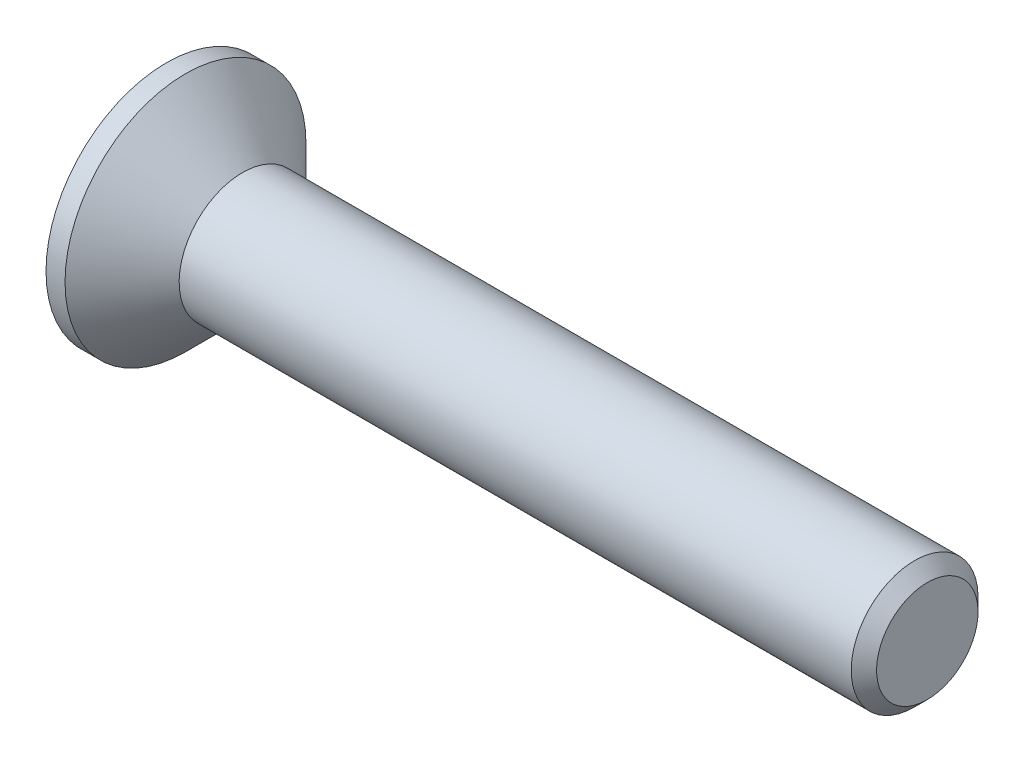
ISO-10303-21;
HEADER;
FILE_DESCRIPTION(('STEP AP214'),'2;1');
FILE_NAME('part.step','',(''),(''),'','','');
FILE_SCHEMA(('AUTOMOTIVE_DESIGN { 1 0 10303 214 1 1 1 1 }'));
ENDSEC;
DATA;
#1=APPLICATION_CONTEXT('core data for automotive mechanical design processes');
#2=APPLICATION_PROTOCOL_DEFINITION('international standard','automotive_design',2000,#1);
#3=PRODUCT_CONTEXT('',#1,'mechanical');
#4=PRODUCT('Part','Part','',(#3));
#5=PRODUCT_RELATED_PRODUCT_CATEGORY('part','',(#4));
#6=PRODUCT_DEFINITION_FORMATION('','',#4);
#7=PRODUCT_DEFINITION_CONTEXT('part definition',#1,'design');
#8=PRODUCT_DEFINITION('design','',#6,#7);
#9=PRODUCT_DEFINITION_SHAPE('','',#8);
#10=(LENGTH_UNIT() NAMED_UNIT(*) SI_UNIT(.MILLI.,.METRE.));
#11=(NAMED_UNIT(*) PLANE_ANGLE_UNIT() SI_UNIT($,.RADIAN.));
#12=(NAMED_UNIT(*) SI_UNIT($,.STERADIAN.) SOLID_ANGLE_UNIT());
#13=UNCERTAINTY_MEASURE_WITH_UNIT(LENGTH_MEASURE(1.E-05),#10,'distance_accuracy_value','');
#14=(GEOMETRIC_REPRESENTATION_CONTEXT(3) GLOBAL_UNCERTAINTY_ASSIGNED_CONTEXT((#13)) GLOBAL_UNIT_ASSIGNED_CONTEXT((#10,
#11,#12)) REPRESENTATION_CONTEXT('',''));
#15=CARTESIAN_POINT('',(0.,0.,0.));
#16=DIRECTION('',(0.,0.,1.));
#17=DIRECTION('',(1.,0.,0.));
#18=AXIS2_PLACEMENT_3D('',#15,#16,#17);
#19=CARTESIAN_POINT('',(0.,0.,0.));
#20=DIRECTION('',(-1.,0.,0.));
#21=DIRECTION('',(0.,-1.,0.));
#22=AXIS2_PLACEMENT_3D('',#19,#20,#21);
#23=CONICAL_SURFACE('',#22,1.,0.78539816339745);
#24=CARTESIAN_POINT('',(-0.899999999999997,0.,0.));
#25=DIRECTION('',(-1.,0.,0.));
#26=DIRECTION('',(0.,-1.,0.));
#27=AXIS2_PLACEMENT_3D('',#24,#25,#26);
#28=CIRCLE('',#27,1.9);
#29=CARTESIAN_POINT('',(-0.899999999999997,-1.9,0.));
#30=VERTEX_POINT('',#29);
#31=EDGE_CURVE('E189',#30,#30,#28,.T.);
#32=ORIENTED_EDGE('',*,*,#31,.F.);
#33=EDGE_LOOP('',(#32));
#34=FACE_BOUND('',#33,.T.);
#35=CARTESIAN_POINT('',(0.,0.,0.));
#36=DIRECTION('',(-1.,0.,0.));
#37=DIRECTION('',(0.,-1.,0.));
#38=AXIS2_PLACEMENT_3D('',#35,#36,#37);
#39=CIRCLE('',#38,1.);
#40=CARTESIAN_POINT('',(0.,-1.,0.));
#41=VERTEX_POINT('',#40);
#42=EDGE_CURVE('E212',#41,#41,#39,.T.);
#43=ORIENTED_EDGE('',*,*,#42,.T.);
#44=EDGE_LOOP('',(#43));
#45=FACE_BOUND('',#44,.T.);
#46=ADVANCED_FACE('F33',(#34,#45),#23,.T.);
#47=CARTESIAN_POINT('',(-1.2,0.,0.));
#48=DIRECTION('',(-1.,0.,0.));
#49=DIRECTION('',(0.,-1.,0.));
#50=AXIS2_PLACEMENT_3D('',#47,#48,#49);
#51=CYLINDRICAL_SURFACE('',#50,1.);
#52=CARTESIAN_POINT('',(10.6,0.,0.));
#53=DIRECTION('',(-1.,0.,0.));
#54=DIRECTION('',(0.,-1.,0.));
#55=AXIS2_PLACEMENT_3D('',#52,#53,#54);
#56=CIRCLE('',#55,1.);
#57=CARTESIAN_POINT('',(10.6,-1.,0.));
#58=VERTEX_POINT('',#57);
#59=EDGE_CURVE('E41',#58,#58,#56,.T.);
#60=ORIENTED_EDGE('',*,*,#59,.T.);
#61=EDGE_LOOP('',(#60));
#62=FACE_BOUND('',#61,.T.);
#63=ORIENTED_EDGE('',*,*,#42,.F.);
#64=EDGE_LOOP('',(#63));
#65=FACE_BOUND('',#64,.T.);
#66=ADVANCED_FACE('F217',(#62,#65),#51,.T.);
#67=CARTESIAN_POINT('',(10.8,0.,0.));
#68=DIRECTION('',(-1.,0.,0.));
#69=DIRECTION('',(0.,-1.,0.));
#70=AXIS2_PLACEMENT_3D('',#67,#68,#69);
#71=PLANE('',#70);
#72=CARTESIAN_POINT('',(10.8,0.,0.));
#73=DIRECTION('',(-1.,0.,0.));
#74=DIRECTION('',(0.,-1.,0.));
#75=AXIS2_PLACEMENT_3D('',#72,#73,#74);
#76=CIRCLE('',#75,0.800000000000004);
#77=CARTESIAN_POINT('',(10.8,-0.800000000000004,0.));
#78=VERTEX_POINT('',#77);
#79=EDGE_CURVE('E11',#78,#78,#76,.F.);
#80=ORIENTED_EDGE('',*,*,#79,.T.);
#81=EDGE_LOOP('',(#80));
#82=FACE_BOUND('',#81,.T.);
#83=ADVANCED_FACE('F239',(#82),#71,.F.);
#84=CARTESIAN_POINT('',(-1.2,1.9,0.));
#85=DIRECTION('',(1.,0.,0.));
#86=DIRECTION('',(0.,1.,0.));
#87=AXIS2_PLACEMENT_3D('',#84,#85,#86);
#88=PLANE('',#87);
#89=DIRECTION('',(0.,0.,-1.));
#90=VECTOR('',#89,1.);
#91=CARTESIAN_POINT('',(-1.2,0.3,-1.175));
#92=LINE('',#91,#90);
#93=CARTESIAN_POINT('',(-1.2,0.3,-0.3));
#94=VERTEX_POINT('',#93);
#95=CARTESIAN_POINT('',(-1.2,0.3,-1.175));
#96=VERTEX_POINT('',#95);
#97=EDGE_CURVE('E158',#94,#96,#92,.T.);
#98=ORIENTED_EDGE('',*,*,#97,.F.);
#99=DIRECTION('',(0.,-1.,0.));
#100=VECTOR('',#99,1.);
#101=CARTESIAN_POINT('',(-1.2,0.3,-0.3));
#102=LINE('',#101,#100);
#103=CARTESIAN_POINT('',(-1.2,1.175,-0.3));
#104=VERTEX_POINT('',#103);
#105=EDGE_CURVE('E48',#104,#94,#102,.T.);
#106=ORIENTED_EDGE('',*,*,#105,.F.);
#107=DIRECTION('',(0.,0.,-1.));
#108=VECTOR('',#107,1.);
#109=CARTESIAN_POINT('',(-1.2,1.175,-0.3));
#110=LINE('',#109,#108);
#111=CARTESIAN_POINT('',(-1.2,1.175,0.3));
#112=VERTEX_POINT('',#111);
#113=EDGE_CURVE('E185',#112,#104,#110,.T.);
#114=ORIENTED_EDGE('',*,*,#113,.F.);
#115=DIRECTION('',(0.,1.,0.));
#116=VECTOR('',#115,1.);
#117=CARTESIAN_POINT('',(-1.2,1.175,0.3));
#118=LINE('',#117,#116);
#119=CARTESIAN_POINT('',(-1.2,0.3,0.3));
#120=VERTEX_POINT('',#119);
#121=EDGE_CURVE('E183',#120,#112,#118,.T.);
#122=ORIENTED_EDGE('',*,*,#121,.F.);
#123=DIRECTION('',(0.,0.,-1.));
#124=VECTOR('',#123,1.);
#125=CARTESIAN_POINT('',(-1.2,0.3,0.3));
#126=LINE('',#125,#124);
#127=CARTESIAN_POINT('',(-1.2,0.3,1.175));
#128=VERTEX_POINT('',#127);
#129=EDGE_CURVE('E132',#128,#120,#126,.T.);
#130=ORIENTED_EDGE('',*,*,#129,.F.);
#131=DIRECTION('',(0.,1.,0.));
#132=VECTOR('',#131,1.);
#133=CARTESIAN_POINT('',(-1.2,0.3,1.175));
#134=LINE('',#133,#132);
#135=CARTESIAN_POINT('',(-1.2,-0.3,1.175));
#136=VERTEX_POINT('',#135);
#137=EDGE_CURVE('E179',#136,#128,#134,.T.);
#138=ORIENTED_EDGE('',*,*,#137,.F.);
#139=DIRECTION('',(0.,0.,1.));
#140=VECTOR('',#139,1.);
#141=CARTESIAN_POINT('',(-1.2,-0.3,1.175));
#142=LINE('',#141,#140);
#143=CARTESIAN_POINT('',(-1.2,-0.3,0.3));
#144=VERTEX_POINT('',#143);
#145=EDGE_CURVE('E176',#144,#136,#142,.T.);
#146=ORIENTED_EDGE('',*,*,#145,.F.);
#147=DIRECTION('',(0.,1.,0.));
#148=VECTOR('',#147,1.);
#149=CARTESIAN_POINT('',(-1.2,-0.3,0.3));
#150=LINE('',#149,#148);
#151=CARTESIAN_POINT('',(-1.2,-1.175,0.3));
#152=VERTEX_POINT('',#151);
#153=EDGE_CURVE('E173',#152,#144,#150,.T.);
#154=ORIENTED_EDGE('',*,*,#153,.F.);
#155=DIRECTION('',(0.,0.,1.));
#156=VECTOR('',#155,1.);
#157=CARTESIAN_POINT('',(-1.2,-1.175,0.3));
#158=LINE('',#157,#156);
#159=CARTESIAN_POINT('',(-1.2,-1.175,-0.3));
#160=VERTEX_POINT('',#159);
#161=EDGE_CURVE('E170',#160,#152,#158,.T.);
#162=ORIENTED_EDGE('',*,*,#161,.F.);
#163=DIRECTION('',(0.,-1.,0.));
#164=VECTOR('',#163,1.);
#165=CARTESIAN_POINT('',(-1.2,-1.175,-0.3));
#166=LINE('',#165,#164);
#167=CARTESIAN_POINT('',(-1.2,-0.3,-0.3));
#168=VERTEX_POINT('',#167);
#169=EDGE_CURVE('E167',#168,#160,#166,.T.);
#170=ORIENTED_EDGE('',*,*,#169,.F.);
#171=DIRECTION('',(0.,0.,1.));
#172=VECTOR('',#171,1.);
#173=CARTESIAN_POINT('',(-1.2,-0.3,-0.3));
#174=LINE('',#173,#172);
#175=CARTESIAN_POINT('',(-1.2,-0.3,-1.175));
#176=VERTEX_POINT('',#175);
#177=EDGE_CURVE('E164',#176,#168,#174,.T.);
#178=ORIENTED_EDGE('',*,*,#177,.F.);
#179=DIRECTION('',(0.,-1.,0.));
#180=VECTOR('',#179,1.);
#181=CARTESIAN_POINT('',(-1.2,-0.3,-1.175));
#182=LINE('',#181,#180);
#183=EDGE_CURVE('E161',#96,#176,#182,.T.);
#184=ORIENTED_EDGE('',*,*,#183,.F.);
#185=EDGE_LOOP('',(#98,#106,#114,#122,#130,#138,#146,#154,#162,#170,#178,#184));
#186=FACE_BOUND('',#185,.T.);
#187=CARTESIAN_POINT('',(-1.2,0.,0.));
#188=DIRECTION('',(-1.,0.,0.));
#189=DIRECTION('',(0.,-1.,0.));
#190=AXIS2_PLACEMENT_3D('',#187,#188,#189);
#191=CIRCLE('',#190,1.9);
#192=CARTESIAN_POINT('',(-1.2,-1.9,0.));
#193=VERTEX_POINT('',#192);
#194=EDGE_CURVE('E209',#193,#193,#191,.T.);
#195=ORIENTED_EDGE('',*,*,#194,.T.);
#196=EDGE_LOOP('',(#195));
#197=FACE_BOUND('',#196,.T.);
#198=ADVANCED_FACE('F230',(#186,#197),#88,.F.);
#199=CARTESIAN_POINT('',(-1.2,0.,0.));
#200=DIRECTION('',(-1.,0.,0.));
#201=DIRECTION('',(0.,-1.,0.));
#202=AXIS2_PLACEMENT_3D('',#199,#200,#201);
#203=CYLINDRICAL_SURFACE('',#202,1.9);
#204=ORIENTED_EDGE('',*,*,#194,.F.);
#205=EDGE_LOOP('',(#204));
#206=FACE_BOUND('',#205,.T.);
#207=ORIENTED_EDGE('',*,*,#31,.T.);
#208=EDGE_LOOP('',(#207));
#209=FACE_BOUND('',#208,.T.);
#210=ADVANCED_FACE('F222',(#206,#209),#203,.T.);
#211=CARTESIAN_POINT('',(10.6,0.,0.));
#212=DIRECTION('',(-1.,0.,0.));
#213=DIRECTION('',(0.,-1.,0.));
#214=AXIS2_PLACEMENT_3D('',#211,#212,#213);
#215=CONICAL_SURFACE('',#214,1.,0.785398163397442);
#216=ORIENTED_EDGE('',*,*,#79,.F.);
#217=EDGE_LOOP('',(#216));
#218=FACE_BOUND('',#217,.T.);
#219=ORIENTED_EDGE('',*,*,#59,.F.);
#220=EDGE_LOOP('',(#219));
#221=FACE_BOUND('',#220,.T.);
#222=ADVANCED_FACE('F35',(#218,#221),#215,.T.);
#223=CARTESIAN_POINT('',(-0.249999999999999,0.3,-0.3));
#224=DIRECTION('',(0.,0.,-1.));
#225=DIRECTION('',(0.,1.,0.));
#226=AXIS2_PLACEMENT_3D('',#223,#224,#225);
#227=PLANE('',#226);
#228=ORIENTED_EDGE('',*,*,#105,.T.);
#229=DIRECTION('',(-1.,0.,0.));
#230=VECTOR('',#229,1.);
#231=CARTESIAN_POINT('',(-0.249999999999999,0.3,-0.3));
#232=LINE('',#231,#230);
#233=CARTESIAN_POINT('',(-0.249999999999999,0.3,-0.3));
#234=VERTEX_POINT('',#233);
#235=EDGE_CURVE('E96',#234,#94,#232,.T.);
#236=ORIENTED_EDGE('',*,*,#235,.F.);
#237=DIRECTION('',(0.,-1.,0.));
#238=VECTOR('',#237,1.);
#239=CARTESIAN_POINT('',(-0.249999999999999,0.3,-0.3));
#240=LINE('',#239,#238);
#241=CARTESIAN_POINT('',(-0.249999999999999,1.175,-0.3));
#242=VERTEX_POINT('',#241);
#243=EDGE_CURVE('E187',#242,#234,#240,.T.);
#244=ORIENTED_EDGE('',*,*,#243,.F.);
#245=DIRECTION('',(-1.,0.,0.));
#246=VECTOR('',#245,1.);
#247=CARTESIAN_POINT('',(-0.249999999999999,1.175,-0.3));
#248=LINE('',#247,#246);
#249=EDGE_CURVE('E56',#242,#104,#248,.T.);
#250=ORIENTED_EDGE('',*,*,#249,.T.);
#251=EDGE_LOOP('',(#228,#236,#244,#250));
#252=FACE_BOUND('',#251,.T.);
#253=ADVANCED_FACE('F221',(#252),#227,.F.);
#254=CARTESIAN_POINT('',(-0.249999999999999,1.175,-0.3));
#255=DIRECTION('',(0.,1.,0.));
#256=DIRECTION('',(-1.,0.,0.));
#257=AXIS2_PLACEMENT_3D('',#254,#255,#256);
#258=PLANE('',#257);
#259=ORIENTED_EDGE('',*,*,#113,.T.);
#260=ORIENTED_EDGE('',*,*,#249,.F.);
#261=DIRECTION('',(0.,0.,-1.));
#262=VECTOR('',#261,1.);
#263=CARTESIAN_POINT('',(-0.249999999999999,1.175,-0.3));
#264=LINE('',#263,#262);
#265=CARTESIAN_POINT('',(-0.249999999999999,1.175,0.3));
#266=VERTEX_POINT('',#265);
#267=EDGE_CURVE('E144',#266,#242,#264,.T.);
#268=ORIENTED_EDGE('',*,*,#267,.F.);
#269=DIRECTION('',(-1.,0.,0.));
#270=VECTOR('',#269,1.);
#271=CARTESIAN_POINT('',(-0.249999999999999,1.175,0.3));
#272=LINE('',#271,#270);
#273=EDGE_CURVE('E136',#266,#112,#272,.T.);
#274=ORIENTED_EDGE('',*,*,#273,.T.);
#275=EDGE_LOOP('',(#259,#260,#268,#274));
#276=FACE_BOUND('',#275,.T.);
#277=ADVANCED_FACE('F228',(#276),#258,.F.);
#278=CARTESIAN_POINT('',(-0.249999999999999,1.175,0.3));
#279=DIRECTION('',(0.,0.,1.));
#280=DIRECTION('',(0.,-1.,0.));
#281=AXIS2_PLACEMENT_3D('',#278,#279,#280);
#282=PLANE('',#281);
#283=ORIENTED_EDGE('',*,*,#121,.T.);
#284=ORIENTED_EDGE('',*,*,#273,.F.);
#285=DIRECTION('',(0.,1.,0.));
#286=VECTOR('',#285,1.);
#287=CARTESIAN_POINT('',(-0.249999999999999,1.175,0.3));
#288=LINE('',#287,#286);
#289=CARTESIAN_POINT('',(-0.249999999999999,0.3,0.3));
#290=VERTEX_POINT('',#289);
#291=EDGE_CURVE('E140',#290,#266,#288,.T.);
#292=ORIENTED_EDGE('',*,*,#291,.F.);
#293=DIRECTION('',(-1.,0.,0.));
#294=VECTOR('',#293,1.);
#295=CARTESIAN_POINT('',(-0.249999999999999,0.3,0.3));
#296=LINE('',#295,#294);
#297=EDGE_CURVE('E125',#290,#120,#296,.T.);
#298=ORIENTED_EDGE('',*,*,#297,.T.);
#299=EDGE_LOOP('',(#283,#284,#292,#298));
#300=FACE_BOUND('',#299,.T.);
#301=ADVANCED_FACE('F141',(#300),#282,.F.);
#302=CARTESIAN_POINT('',(-0.249999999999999,0.3,0.3));
#303=DIRECTION('',(0.,1.,0.));
#304=DIRECTION('',(0.,0.,1.));
#305=AXIS2_PLACEMENT_3D('',#302,#303,#304);
#306=PLANE('',#305);
#307=ORIENTED_EDGE('',*,*,#129,.T.);
#308=ORIENTED_EDGE('',*,*,#297,.F.);
#309=DIRECTION('',(0.,0.,-1.));
#310=VECTOR('',#309,1.);
#311=CARTESIAN_POINT('',(-0.249999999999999,0.3,0.3));
#312=LINE('',#311,#310);
#313=CARTESIAN_POINT('',(-0.249999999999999,0.3,1.175));
#314=VERTEX_POINT('',#313);
#315=EDGE_CURVE('E129',#314,#290,#312,.T.);
#316=ORIENTED_EDGE('',*,*,#315,.F.);
#317=DIRECTION('',(-1.,0.,0.));
#318=VECTOR('',#317,1.);
#319=CARTESIAN_POINT('',(-0.249999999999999,0.3,1.175));
#320=LINE('',#319,#318);
#321=EDGE_CURVE('E137',#314,#128,#320,.T.);
#322=ORIENTED_EDGE('',*,*,#321,.T.);
#323=EDGE_LOOP('',(#307,#308,#316,#322));
#324=FACE_BOUND('',#323,.T.);
#325=ADVANCED_FACE('F127',(#324),#306,.F.);
#326=CARTESIAN_POINT('',(-0.249999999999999,0.3,1.175));
#327=DIRECTION('',(0.,0.,1.));
#328=DIRECTION('',(1.,0.,0.));
#329=AXIS2_PLACEMENT_3D('',#326,#327,#328);
#330=PLANE('',#329);
#331=ORIENTED_EDGE('',*,*,#137,.T.);
#332=ORIENTED_EDGE('',*,*,#321,.F.);
#333=DIRECTION('',(0.,1.,0.));
#334=VECTOR('',#333,1.);
#335=CARTESIAN_POINT('',(-0.249999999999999,0.3,1.175));
#336=LINE('',#335,#334);
#337=CARTESIAN_POINT('',(-0.249999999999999,-0.3,1.175));
#338=VERTEX_POINT('',#337);
#339=EDGE_CURVE('E150',#338,#314,#336,.T.);
#340=ORIENTED_EDGE('',*,*,#339,.F.);
#341=DIRECTION('',(-1.,0.,0.));
#342=VECTOR('',#341,1.);
#343=CARTESIAN_POINT('',(-0.249999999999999,-0.3,1.175));
#344=LINE('',#343,#342);
#345=EDGE_CURVE('E192',#338,#136,#344,.T.);
#346=ORIENTED_EDGE('',*,*,#345,.T.);
#347=EDGE_LOOP('',(#331,#332,#340,#346));
#348=FACE_BOUND('',#347,.T.);
#349=ADVANCED_FACE('F277',(#348),#330,.F.);
#350=CARTESIAN_POINT('',(-0.249999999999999,-0.3,1.175));
#351=DIRECTION('',(0.,-1.,0.));
#352=DIRECTION('',(0.,0.,-1.));
#353=AXIS2_PLACEMENT_3D('',#350,#351,#352);
#354=PLANE('',#353);
#355=ORIENTED_EDGE('',*,*,#145,.T.);
#356=ORIENTED_EDGE('',*,*,#345,.F.);
#357=DIRECTION('',(0.,0.,1.));
#358=VECTOR('',#357,1.);
#359=CARTESIAN_POINT('',(-0.249999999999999,-0.3,1.175));
#360=LINE('',#359,#358);
#361=CARTESIAN_POINT('',(-0.249999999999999,-0.3,0.3));
#362=VERTEX_POINT('',#361);
#363=EDGE_CURVE('E152',#362,#338,#360,.T.);
#364=ORIENTED_EDGE('',*,*,#363,.F.);
#365=DIRECTION('',(-1.,0.,0.));
#366=VECTOR('',#365,1.);
#367=CARTESIAN_POINT('',(-0.249999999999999,-0.3,0.3));
#368=LINE('',#367,#366);
#369=EDGE_CURVE('E194',#362,#144,#368,.T.);
#370=ORIENTED_EDGE('',*,*,#369,.T.);
#371=EDGE_LOOP('',(#355,#356,#364,#370));
#372=FACE_BOUND('',#371,.T.);
#373=ADVANCED_FACE('F273',(#372),#354,.F.);
#374=CARTESIAN_POINT('',(-0.249999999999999,-0.3,0.3));
#375=DIRECTION('',(0.,0.,1.));
#376=DIRECTION('',(1.,0.,0.));
#377=AXIS2_PLACEMENT_3D('',#374,#375,#376);
#378=PLANE('',#377);
#379=ORIENTED_EDGE('',*,*,#153,.T.);
#380=ORIENTED_EDGE('',*,*,#369,.F.);
#381=DIRECTION('',(0.,1.,0.));
#382=VECTOR('',#381,1.);
#383=CARTESIAN_POINT('',(-0.249999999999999,-0.3,0.3));
#384=LINE('',#383,#382);
#385=CARTESIAN_POINT('',(-0.249999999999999,-1.175,0.3));
#386=VERTEX_POINT('',#385);
#387=EDGE_CURVE('E422',#386,#362,#384,.T.);
#388=ORIENTED_EDGE('',*,*,#387,.F.);
#389=DIRECTION('',(-1.,0.,0.));
#390=VECTOR('',#389,1.);
#391=CARTESIAN_POINT('',(-0.249999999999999,-1.175,0.3));
#392=LINE('',#391,#390);
#393=EDGE_CURVE('E196',#386,#152,#392,.T.);
#394=ORIENTED_EDGE('',*,*,#393,.T.);
#395=EDGE_LOOP('',(#379,#380,#388,#394));
#396=FACE_BOUND('',#395,.T.);
#397=ADVANCED_FACE('F269',(#396),#378,.F.);
#398=CARTESIAN_POINT('',(-0.249999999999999,-1.175,0.3));
#399=DIRECTION('',(0.,-1.,0.));
#400=DIRECTION('',(1.,0.,0.));
#401=AXIS2_PLACEMENT_3D('',#398,#399,#400);
#402=PLANE('',#401);
#403=ORIENTED_EDGE('',*,*,#161,.T.);
#404=ORIENTED_EDGE('',*,*,#393,.F.);
#405=DIRECTION('',(0.,0.,1.));
#406=VECTOR('',#405,1.);
#407=CARTESIAN_POINT('',(-0.249999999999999,-1.175,0.3));
#408=LINE('',#407,#406);
#409=CARTESIAN_POINT('',(-0.249999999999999,-1.175,-0.3));
#410=VERTEX_POINT('',#409);
#411=EDGE_CURVE('E419',#410,#386,#408,.T.);
#412=ORIENTED_EDGE('',*,*,#411,.F.);
#413=DIRECTION('',(-1.,0.,0.));
#414=VECTOR('',#413,1.);
#415=CARTESIAN_POINT('',(-0.249999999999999,-1.175,-0.3));
#416=LINE('',#415,#414);
#417=EDGE_CURVE('E198',#410,#160,#416,.T.);
#418=ORIENTED_EDGE('',*,*,#417,.T.);
#419=EDGE_LOOP('',(#403,#404,#412,#418));
#420=FACE_BOUND('',#419,.T.);
#421=ADVANCED_FACE('F265',(#420),#402,.F.);
#422=CARTESIAN_POINT('',(-0.249999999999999,-1.175,-0.3));
#423=DIRECTION('',(0.,0.,-1.));
#424=DIRECTION('',(0.,1.,0.));
#425=AXIS2_PLACEMENT_3D('',#422,#423,#424);
#426=PLANE('',#425);
#427=ORIENTED_EDGE('',*,*,#169,.T.);
#428=ORIENTED_EDGE('',*,*,#417,.F.);
#429=DIRECTION('',(0.,-1.,0.));
#430=VECTOR('',#429,1.);
#431=CARTESIAN_POINT('',(-0.249999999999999,-1.175,-0.3));
#432=LINE('',#431,#430);
#433=CARTESIAN_POINT('',(-0.249999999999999,-0.3,-0.3));
#434=VERTEX_POINT('',#433);
#435=EDGE_CURVE('E416',#434,#410,#432,.T.);
#436=ORIENTED_EDGE('',*,*,#435,.F.);
#437=DIRECTION('',(-1.,0.,0.));
#438=VECTOR('',#437,1.);
#439=CARTESIAN_POINT('',(-0.249999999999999,-0.3,-0.3));
#440=LINE('',#439,#438);
#441=EDGE_CURVE('E200',#434,#168,#440,.T.);
#442=ORIENTED_EDGE('',*,*,#441,.T.);
#443=EDGE_LOOP('',(#427,#428,#436,#442));
#444=FACE_BOUND('',#443,.T.);
#445=ADVANCED_FACE('F261',(#444),#426,.F.);
#446=CARTESIAN_POINT('',(-0.249999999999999,-0.3,-0.3));
#447=DIRECTION('',(0.,-1.,0.));
#448=DIRECTION('',(0.,0.,-1.));
#449=AXIS2_PLACEMENT_3D('',#446,#447,#448);
#450=PLANE('',#449);
#451=ORIENTED_EDGE('',*,*,#177,.T.);
#452=ORIENTED_EDGE('',*,*,#441,.F.);
#453=DIRECTION('',(0.,0.,1.));
#454=VECTOR('',#453,1.);
#455=CARTESIAN_POINT('',(-0.249999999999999,-0.3,-0.3));
#456=LINE('',#455,#454);
#457=CARTESIAN_POINT('',(-0.249999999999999,-0.3,-1.175));
#458=VERTEX_POINT('',#457);
#459=EDGE_CURVE('E413',#458,#434,#456,.T.);
#460=ORIENTED_EDGE('',*,*,#459,.F.);
#461=DIRECTION('',(-1.,0.,0.));
#462=VECTOR('',#461,1.);
#463=CARTESIAN_POINT('',(-0.249999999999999,-0.3,-1.175));
#464=LINE('',#463,#462);
#465=EDGE_CURVE('E202',#458,#176,#464,.T.);
#466=ORIENTED_EDGE('',*,*,#465,.T.);
#467=EDGE_LOOP('',(#451,#452,#460,#466));
#468=FACE_BOUND('',#467,.T.);
#469=ADVANCED_FACE('F257',(#468),#450,.F.);
#470=CARTESIAN_POINT('',(-0.249999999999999,-0.3,-1.175));
#471=DIRECTION('',(0.,0.,-1.));
#472=DIRECTION('',(-1.,0.,0.));
#473=AXIS2_PLACEMENT_3D('',#470,#471,#472);
#474=PLANE('',#473);
#475=ORIENTED_EDGE('',*,*,#183,.T.);
#476=ORIENTED_EDGE('',*,*,#465,.F.);
#477=DIRECTION('',(0.,-1.,0.));
#478=VECTOR('',#477,1.);
#479=CARTESIAN_POINT('',(-0.249999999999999,-0.3,-1.175));
#480=LINE('',#479,#478);
#481=CARTESIAN_POINT('',(-0.249999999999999,0.3,-1.175));
#482=VERTEX_POINT('',#481);
#483=EDGE_CURVE('E408',#482,#458,#480,.T.);
#484=ORIENTED_EDGE('',*,*,#483,.F.);
#485=DIRECTION('',(-1.,0.,0.));
#486=VECTOR('',#485,1.);
#487=CARTESIAN_POINT('',(-0.249999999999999,0.3,-1.175));
#488=LINE('',#487,#486);
#489=EDGE_CURVE('E204',#482,#96,#488,.T.);
#490=ORIENTED_EDGE('',*,*,#489,.T.);
#491=EDGE_LOOP('',(#475,#476,#484,#490));
#492=FACE_BOUND('',#491,.T.);
#493=ADVANCED_FACE('F253',(#492),#474,.F.);
#494=CARTESIAN_POINT('',(-0.249999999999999,0.3,-1.175));
#495=DIRECTION('',(0.,1.,0.));
#496=DIRECTION('',(0.,0.,1.));
#497=AXIS2_PLACEMENT_3D('',#494,#495,#496);
#498=PLANE('',#497);
#499=ORIENTED_EDGE('',*,*,#97,.T.);
#500=ORIENTED_EDGE('',*,*,#489,.F.);
#501=DIRECTION('',(0.,0.,-1.));
#502=VECTOR('',#501,1.);
#503=CARTESIAN_POINT('',(-0.249999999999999,0.3,-1.175));
#504=LINE('',#503,#502);
#505=EDGE_CURVE('E406',#234,#482,#504,.T.);
#506=ORIENTED_EDGE('',*,*,#505,.F.);
#507=ORIENTED_EDGE('',*,*,#235,.T.);
#508=EDGE_LOOP('',(#499,#500,#506,#507));
#509=FACE_BOUND('',#508,.T.);
#510=ADVANCED_FACE('F250',(#509),#498,.F.);
#511=CARTESIAN_POINT('',(-0.249999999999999,0.,0.));
#512=DIRECTION('',(1.,0.,0.));
#513=DIRECTION('',(0.,0.,-1.));
#514=AXIS2_PLACEMENT_3D('',#511,#512,#513);
#515=PLANE('',#514);
#516=ORIENTED_EDGE('',*,*,#243,.T.);
#517=ORIENTED_EDGE('',*,*,#505,.T.);
#518=ORIENTED_EDGE('',*,*,#483,.T.);
#519=ORIENTED_EDGE('',*,*,#459,.T.);
#520=ORIENTED_EDGE('',*,*,#435,.T.);
#521=ORIENTED_EDGE('',*,*,#411,.T.);
#522=ORIENTED_EDGE('',*,*,#387,.T.);
#523=ORIENTED_EDGE('',*,*,#363,.T.);
#524=ORIENTED_EDGE('',*,*,#339,.T.);
#525=ORIENTED_EDGE('',*,*,#315,.T.);
#526=ORIENTED_EDGE('',*,*,#291,.T.);
#527=ORIENTED_EDGE('',*,*,#267,.T.);
#528=EDGE_LOOP('',(#516,#517,#518,#519,#520,#521,#522,#523,#524,#525,#526,#527));
#529=FACE_BOUND('',#528,.T.);
#530=ADVANCED_FACE('F147',(#529),#515,.F.);
#531=CLOSED_SHELL('',(#46,#66,#83,#198,#210,#222,#253,#277,#301,#325,#349,#373,#397,#421,#445,
#469,#493,#510,#530));
#532=MANIFOLD_SOLID_BREP('B2',#531);
#533=ADVANCED_BREP_SHAPE_REPRESENTATION('',(#18,#532),#14);
#534=SHAPE_DEFINITION_REPRESENTATION(#9,#533);
ENDSEC;
END-ISO-10303-21;
